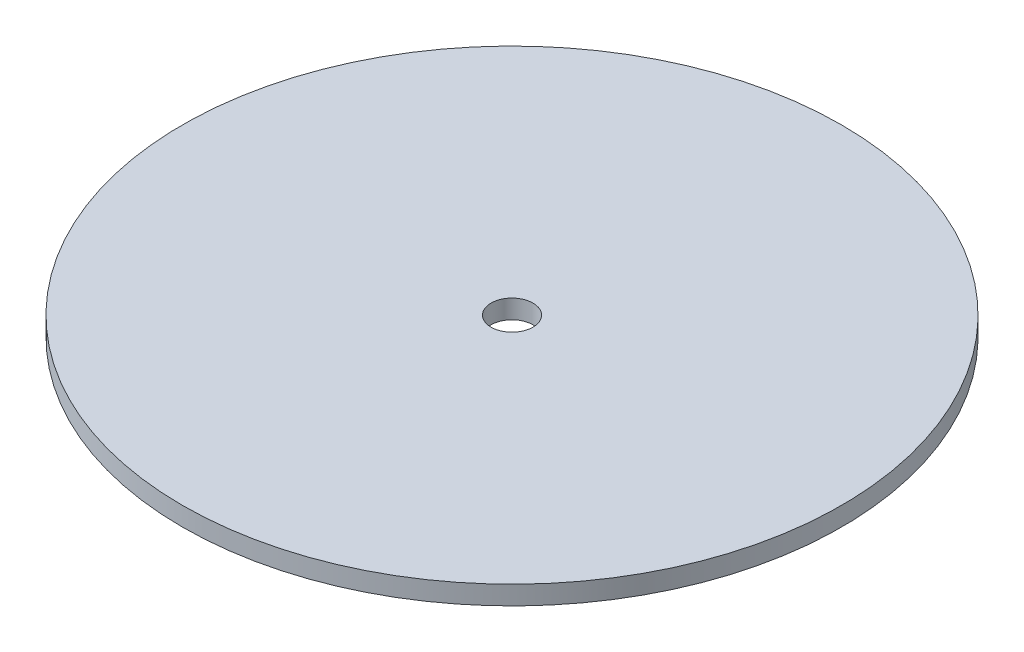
ISO-10303-21;
HEADER;
FILE_DESCRIPTION(('STEP AP214'),'2;1');
FILE_NAME('part.step','',(''),(''),'','','');
FILE_SCHEMA(('AUTOMOTIVE_DESIGN { 1 0 10303 214 1 1 1 1 }'));
ENDSEC;
DATA;
#1=APPLICATION_CONTEXT('core data for automotive mechanical design processes');
#2=APPLICATION_PROTOCOL_DEFINITION('international standard','automotive_design',2000,#1);
#3=PRODUCT_CONTEXT('',#1,'mechanical');
#4=PRODUCT('Part','Part','',(#3));
#5=PRODUCT_RELATED_PRODUCT_CATEGORY('part','',(#4));
#6=PRODUCT_DEFINITION_FORMATION('','',#4);
#7=PRODUCT_DEFINITION_CONTEXT('part definition',#1,'design');
#8=PRODUCT_DEFINITION('design','',#6,#7);
#9=PRODUCT_DEFINITION_SHAPE('','',#8);
#10=(LENGTH_UNIT() NAMED_UNIT(*) SI_UNIT(.MILLI.,.METRE.));
#11=(NAMED_UNIT(*) PLANE_ANGLE_UNIT() SI_UNIT($,.RADIAN.));
#12=(NAMED_UNIT(*) SI_UNIT($,.STERADIAN.) SOLID_ANGLE_UNIT());
#13=UNCERTAINTY_MEASURE_WITH_UNIT(LENGTH_MEASURE(1.E-05),#10,'distance_accuracy_value','');
#14=(GEOMETRIC_REPRESENTATION_CONTEXT(3) GLOBAL_UNCERTAINTY_ASSIGNED_CONTEXT((#13)) GLOBAL_UNIT_ASSIGNED_CONTEXT((#10,
#11,#12)) REPRESENTATION_CONTEXT('',''));
#15=CARTESIAN_POINT('',(0.,0.,0.));
#16=DIRECTION('',(0.,0.,1.));
#17=DIRECTION('',(1.,0.,0.));
#18=AXIS2_PLACEMENT_3D('',#15,#16,#17);
#19=CARTESIAN_POINT('',(0.,0.9,0.));
#20=DIRECTION('',(0.,1.,0.));
#21=DIRECTION('',(0.,0.,1.));
#22=AXIS2_PLACEMENT_3D('',#19,#20,#21);
#23=PLANE('',#22);
#24=CARTESIAN_POINT('',(0.,0.9,0.));
#25=DIRECTION('',(0.,1.,0.));
#26=DIRECTION('',(0.,0.,1.));
#27=AXIS2_PLACEMENT_3D('',#24,#25,#26);
#28=CIRCLE('',#27,31.5);
#29=CARTESIAN_POINT('',(0.,0.9,31.5));
#30=VERTEX_POINT('',#29);
#31=EDGE_CURVE('E10',#30,#30,#28,.T.);
#32=ORIENTED_EDGE('',*,*,#31,.T.);
#33=EDGE_LOOP('',(#32));
#34=FACE_BOUND('',#33,.T.);
#35=CARTESIAN_POINT('',(0.,0.9,0.));
#36=DIRECTION('',(0.,1.,0.));
#37=DIRECTION('',(0.,0.,1.));
#38=AXIS2_PLACEMENT_3D('',#35,#36,#37);
#39=CIRCLE('',#38,2.);
#40=CARTESIAN_POINT('',(0.,0.9,2.));
#41=VERTEX_POINT('',#40);
#42=EDGE_CURVE('E46',#41,#41,#39,.T.);
#43=ORIENTED_EDGE('',*,*,#42,.F.);
#44=EDGE_LOOP('',(#43));
#45=FACE_BOUND('',#44,.T.);
#46=ADVANCED_FACE('F35',(#34,#45),#23,.T.);
#47=CARTESIAN_POINT('',(0.,-0.9,0.));
#48=DIRECTION('',(0.,1.,0.));
#49=DIRECTION('',(0.,0.,1.));
#50=AXIS2_PLACEMENT_3D('',#47,#48,#49);
#51=PLANE('',#50);
#52=CARTESIAN_POINT('',(0.,-0.9,0.));
#53=DIRECTION('',(0.,1.,0.));
#54=DIRECTION('',(0.,0.,1.));
#55=AXIS2_PLACEMENT_3D('',#52,#53,#54);
#56=CIRCLE('',#55,31.5);
#57=CARTESIAN_POINT('',(0.,-0.9,31.5));
#58=VERTEX_POINT('',#57);
#59=EDGE_CURVE('E39',#58,#58,#56,.T.);
#60=ORIENTED_EDGE('',*,*,#59,.F.);
#61=EDGE_LOOP('',(#60));
#62=FACE_BOUND('',#61,.T.);
#63=CARTESIAN_POINT('',(0.,-0.9,0.));
#64=DIRECTION('',(0.,1.,0.));
#65=DIRECTION('',(0.,0.,1.));
#66=AXIS2_PLACEMENT_3D('',#63,#64,#65);
#67=CIRCLE('',#66,2.);
#68=CARTESIAN_POINT('',(0.,-0.9,2.));
#69=VERTEX_POINT('',#68);
#70=EDGE_CURVE('E48',#69,#69,#67,.T.);
#71=ORIENTED_EDGE('',*,*,#70,.T.);
#72=EDGE_LOOP('',(#71));
#73=FACE_BOUND('',#72,.T.);
#74=ADVANCED_FACE('F58',(#62,#73),#51,.F.);
#75=CARTESIAN_POINT('',(0.,0.9,0.));
#76=DIRECTION('',(0.,-1.,0.));
#77=DIRECTION('',(0.,0.,-1.));
#78=AXIS2_PLACEMENT_3D('',#75,#76,#77);
#79=CYLINDRICAL_SURFACE('',#78,31.5);
#80=ORIENTED_EDGE('',*,*,#31,.F.);
#81=EDGE_LOOP('',(#80));
#82=FACE_BOUND('',#81,.T.);
#83=ORIENTED_EDGE('',*,*,#59,.T.);
#84=EDGE_LOOP('',(#83));
#85=FACE_BOUND('',#84,.T.);
#86=ADVANCED_FACE('F37',(#82,#85),#79,.T.);
#87=CARTESIAN_POINT('',(0.,0.9,0.));
#88=DIRECTION('',(0.,-1.,0.));
#89=DIRECTION('',(0.,0.,-1.));
#90=AXIS2_PLACEMENT_3D('',#87,#88,#89);
#91=CYLINDRICAL_SURFACE('',#90,2.);
#92=ORIENTED_EDGE('',*,*,#42,.T.);
#93=EDGE_LOOP('',(#92));
#94=FACE_BOUND('',#93,.T.);
#95=ORIENTED_EDGE('',*,*,#70,.F.);
#96=EDGE_LOOP('',(#95));
#97=FACE_BOUND('',#96,.T.);
#98=ADVANCED_FACE('F54',(#94,#97),#91,.F.);
#99=CLOSED_SHELL('',(#46,#74,#86,#98));
#100=MANIFOLD_SOLID_BREP('B2',#99);
#101=ADVANCED_BREP_SHAPE_REPRESENTATION('',(#18,#100),#14);
#102=SHAPE_DEFINITION_REPRESENTATION(#9,#101);
ENDSEC;
END-ISO-10303-21;
